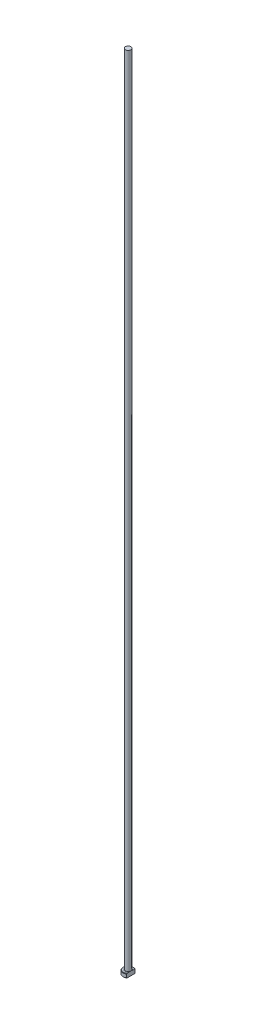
ISO-10303-21;
HEADER;
FILE_DESCRIPTION(('STEP AP214'),'2;1');
FILE_NAME('part.step','',(''),(''),'','','');
FILE_SCHEMA(('AUTOMOTIVE_DESIGN { 1 0 10303 214 1 1 1 1 }'));
ENDSEC;
DATA;
#1=APPLICATION_CONTEXT('core data for automotive mechanical design processes');
#2=APPLICATION_PROTOCOL_DEFINITION('international standard','automotive_design',2000,#1);
#3=PRODUCT_CONTEXT('',#1,'mechanical');
#4=PRODUCT('Part','Part','',(#3));
#5=PRODUCT_RELATED_PRODUCT_CATEGORY('part','',(#4));
#6=PRODUCT_DEFINITION_FORMATION('','',#4);
#7=PRODUCT_DEFINITION_CONTEXT('part definition',#1,'design');
#8=PRODUCT_DEFINITION('design','',#6,#7);
#9=PRODUCT_DEFINITION_SHAPE('','',#8);
#10=(LENGTH_UNIT() NAMED_UNIT(*) SI_UNIT(.MILLI.,.METRE.));
#11=(NAMED_UNIT(*) PLANE_ANGLE_UNIT() SI_UNIT($,.RADIAN.));
#12=(NAMED_UNIT(*) SI_UNIT($,.STERADIAN.) SOLID_ANGLE_UNIT());
#13=UNCERTAINTY_MEASURE_WITH_UNIT(LENGTH_MEASURE(1.E-05),#10,'distance_accuracy_value','');
#14=(GEOMETRIC_REPRESENTATION_CONTEXT(3) GLOBAL_UNCERTAINTY_ASSIGNED_CONTEXT((#13)) GLOBAL_UNIT_ASSIGNED_CONTEXT((#10,
#11,#12)) REPRESENTATION_CONTEXT('',''));
#15=CARTESIAN_POINT('',(0.,0.,0.));
#16=DIRECTION('',(0.,0.,1.));
#17=DIRECTION('',(1.,0.,0.));
#18=AXIS2_PLACEMENT_3D('',#15,#16,#17);
#19=CARTESIAN_POINT('',(0.,0.,0.));
#20=DIRECTION('',(0.,-1.,0.));
#21=DIRECTION('',(0.,0.,-1.));
#22=AXIS2_PLACEMENT_3D('',#19,#20,#21);
#23=PLANE('',#22);
#24=CARTESIAN_POINT('',(0.,0.,0.));
#25=DIRECTION('',(0.,-1.,0.));
#26=DIRECTION('',(0.,0.,-1.));
#27=AXIS2_PLACEMENT_3D('',#24,#25,#26);
#28=CIRCLE('',#27,2.30000000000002);
#29=CARTESIAN_POINT('',(1.34999999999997,0.,1.86212244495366));
#30=VERTEX_POINT('',#29);
#31=CARTESIAN_POINT('',(1.34999999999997,0.,-1.86212244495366));
#32=VERTEX_POINT('',#31);
#33=EDGE_CURVE('E98',#30,#32,#28,.T.);
#34=ORIENTED_EDGE('',*,*,#33,.T.);
#35=DIRECTION('',(0.,0.,1.));
#36=VECTOR('',#35,1.);
#37=CARTESIAN_POINT('',(1.34999999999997,0.,-2.10416254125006));
#38=LINE('',#37,#36);
#39=EDGE_CURVE('E83',#32,#30,#38,.T.);
#40=ORIENTED_EDGE('',*,*,#39,.T.);
#41=EDGE_LOOP('',(#34,#40));
#42=FACE_BOUND('',#41,.T.);
#43=ADVANCED_FACE('F32',(#42),#23,.T.);
#44=CARTESIAN_POINT('',(0.,259.958771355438,0.));
#45=DIRECTION('',(0.,1.,0.));
#46=DIRECTION('',(0.,0.,1.));
#47=AXIS2_PLACEMENT_3D('',#44,#45,#46);
#48=CYLINDRICAL_SURFACE('',#47,2.49999999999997);
#49=CARTESIAN_POINT('',(0.,1.79999999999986,0.));
#50=DIRECTION('',(0.,1.,0.));
#51=DIRECTION('',(0.,0.,1.));
#52=AXIS2_PLACEMENT_3D('',#49,#50,#51);
#53=CIRCLE('',#52,2.49999999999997);
#54=CARTESIAN_POINT('',(1.34999999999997,1.79999999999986,2.10416254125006));
#55=VERTEX_POINT('',#54);
#56=CARTESIAN_POINT('',(1.34999999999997,1.79999999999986,-2.10416254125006));
#57=VERTEX_POINT('',#56);
#58=EDGE_CURVE('E104',#55,#57,#53,.F.);
#59=ORIENTED_EDGE('',*,*,#58,.T.);
#60=DIRECTION('',(0.,-1.,0.));
#61=VECTOR('',#60,1.);
#62=CARTESIAN_POINT('',(1.34999999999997,400.,-2.10416254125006));
#63=LINE('',#62,#61);
#64=CARTESIAN_POINT('',(1.34999999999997,0.199999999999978,-2.10416254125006));
#65=VERTEX_POINT('',#64);
#66=EDGE_CURVE('E183',#57,#65,#63,.T.);
#67=ORIENTED_EDGE('',*,*,#66,.T.);
#68=CARTESIAN_POINT('',(0.,0.199999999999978,0.));
#69=DIRECTION('',(0.,-1.,0.));
#70=DIRECTION('',(0.,0.,-1.));
#71=AXIS2_PLACEMENT_3D('',#68,#69,#70);
#72=CIRCLE('',#71,2.49999999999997);
#73=CARTESIAN_POINT('',(1.34999999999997,0.199999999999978,2.10416254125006));
#74=VERTEX_POINT('',#73);
#75=EDGE_CURVE('E100',#65,#74,#72,.F.);
#76=ORIENTED_EDGE('',*,*,#75,.T.);
#77=DIRECTION('',(0.,-1.,0.));
#78=VECTOR('',#77,1.);
#79=CARTESIAN_POINT('',(1.34999999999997,400.,2.10416254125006));
#80=LINE('',#79,#78);
#81=EDGE_CURVE('E93',#55,#74,#80,.T.);
#82=ORIENTED_EDGE('',*,*,#81,.F.);
#83=EDGE_LOOP('',(#59,#67,#76,#82));
#84=FACE_BOUND('',#83,.T.);
#85=ADVANCED_FACE('F158',(#84),#48,.T.);
#86=CARTESIAN_POINT('',(-2.49999999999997,2.,0.));
#87=DIRECTION('',(0.,1.,0.));
#88=DIRECTION('',(0.,0.,1.));
#89=AXIS2_PLACEMENT_3D('',#86,#87,#88);
#90=PLANE('',#89);
#91=CARTESIAN_POINT('',(0.,2.,0.));
#92=DIRECTION('',(0.,1.,0.));
#93=DIRECTION('',(0.,0.,1.));
#94=AXIS2_PLACEMENT_3D('',#91,#92,#93);
#95=CIRCLE('',#94,2.29999999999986);
#96=CARTESIAN_POINT('',(1.34999999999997,2.,-1.86212244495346));
#97=VERTEX_POINT('',#96);
#98=CARTESIAN_POINT('',(1.34999999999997,2.,1.86212244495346));
#99=VERTEX_POINT('',#98);
#100=EDGE_CURVE('E178',#97,#99,#95,.T.);
#101=ORIENTED_EDGE('',*,*,#100,.T.);
#102=DIRECTION('',(0.,0.,-1.));
#103=VECTOR('',#102,1.);
#104=CARTESIAN_POINT('',(1.34999999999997,2.,0.));
#105=LINE('',#104,#103);
#106=CARTESIAN_POINT('',(1.34999999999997,1.99999999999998,0.761577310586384));
#107=VERTEX_POINT('',#106);
#108=EDGE_CURVE('E57',#99,#107,#105,.T.);
#109=ORIENTED_EDGE('',*,*,#108,.T.);
#110=CARTESIAN_POINT('',(0.,2.,0.));
#111=DIRECTION('',(0.,1.,0.));
#112=DIRECTION('',(0.,0.,1.));
#113=AXIS2_PLACEMENT_3D('',#110,#111,#112);
#114=CIRCLE('',#113,1.54999999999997);
#115=CARTESIAN_POINT('',(1.34999999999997,1.99999999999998,-0.761577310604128));
#116=VERTEX_POINT('',#115);
#117=EDGE_CURVE('E107',#107,#116,#114,.F.);
#118=ORIENTED_EDGE('',*,*,#117,.T.);
#119=EDGE_CURVE('E136',#116,#97,#105,.T.);
#120=ORIENTED_EDGE('',*,*,#119,.T.);
#121=EDGE_LOOP('',(#101,#109,#118,#120));
#122=FACE_BOUND('',#121,.T.);
#123=ADVANCED_FACE('F147',(#122),#90,.T.);
#124=CARTESIAN_POINT('',(0.,2.,0.));
#125=DIRECTION('',(0.,-1.,0.));
#126=DIRECTION('',(0.,0.,-1.));
#127=AXIS2_PLACEMENT_3D('',#124,#125,#126);
#128=CONICAL_SURFACE('',#127,2.29999999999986,0.785398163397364);
#129=ORIENTED_EDGE('',*,*,#58,.F.);
#130=CARTESIAN_POINT('',(1.34999999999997,-0.524919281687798,4.63220747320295));
#131=CARTESIAN_POINT('',(1.34999999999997,-0.437609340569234,4.54126266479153));
#132=CARTESIAN_POINT('',(1.34999999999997,-0.350401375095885,4.45021982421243));
#133=CARTESIAN_POINT('',(1.34999999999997,-0.176235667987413,4.26789371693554));
#134=CARTESIAN_POINT('',(1.34999999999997,-0.0892779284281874,4.17661044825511));
#135=CARTESIAN_POINT('',(1.34999999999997,0.171198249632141,3.90228319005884));
#136=CARTESIAN_POINT('',(1.34999999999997,0.344269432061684,3.71881394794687));
#137=CARTESIAN_POINT('',(1.34999999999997,0.686339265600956,3.35265578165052));
#138=CARTESIAN_POINT('',(1.34999999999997,0.855361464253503,3.16998895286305));
#139=CARTESIAN_POINT('',(1.34999999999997,1.10676804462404,2.89407002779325));
#140=CARTESIAN_POINT('',(1.34999999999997,1.19021072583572,2.8017829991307));
#141=CARTESIAN_POINT('',(1.34999999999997,1.35616107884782,2.61637299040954));
#142=CARTESIAN_POINT('',(1.34999999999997,1.43866876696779,2.52325002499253));
#143=CARTESIAN_POINT('',(1.34999999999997,1.58666506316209,2.35393986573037));
#144=CARTESIAN_POINT('',(1.34999999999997,1.65237203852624,2.27794381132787));
#145=CARTESIAN_POINT('',(1.34999999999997,1.78272599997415,2.12503384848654));
#146=CARTESIAN_POINT('',(1.34999999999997,1.84737288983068,2.04811985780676));
#147=CARTESIAN_POINT('',(1.34999999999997,1.97578051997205,1.8924719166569));
#148=CARTESIAN_POINT('',(1.34999999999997,2.0395293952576,1.81372814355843));
#149=CARTESIAN_POINT('',(1.34999999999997,2.16502964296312,1.65468665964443));
#150=CARTESIAN_POINT('',(1.34999999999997,2.22678149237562,1.57438932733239));
#151=CARTESIAN_POINT('',(1.34999999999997,2.34821109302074,1.41068778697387));
#152=CARTESIAN_POINT('',(1.34999999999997,2.40785394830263,1.32725749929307));
#153=CARTESIAN_POINT('',(1.34999999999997,2.5229207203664,1.15733795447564));
#154=CARTESIAN_POINT('',(1.34999999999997,2.57833930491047,1.07084502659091));
#155=CARTESIAN_POINT('',(1.34999999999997,2.68200172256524,0.894688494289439));
#156=CARTESIAN_POINT('',(1.34999999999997,2.73030792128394,0.805062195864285));
#157=CARTESIAN_POINT('',(1.34999999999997,2.81628592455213,0.620872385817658));
#158=CARTESIAN_POINT('',(1.34999999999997,2.8539888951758,0.526324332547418));
#159=CARTESIAN_POINT('',(1.34999999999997,2.89712682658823,0.383943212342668));
#160=CARTESIAN_POINT('',(1.34999999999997,2.90904798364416,0.338082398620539));
#161=CARTESIAN_POINT('',(1.34999999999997,2.92861548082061,0.245444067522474));
#162=CARTESIAN_POINT('',(1.34999999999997,2.93626244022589,0.198666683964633));
#163=CARTESIAN_POINT('',(1.34999999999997,2.94673600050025,0.104809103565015));
#164=CARTESIAN_POINT('',(1.34999999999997,2.9495872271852,0.0577317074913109));
#165=CARTESIAN_POINT('',(1.34999999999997,2.95032901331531,-0.0364641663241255));
#166=CARTESIAN_POINT('',(1.34999999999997,2.94821949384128,-0.0835826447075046));
#167=CARTESIAN_POINT('',(1.34999999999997,2.93922391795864,-0.17711502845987));
#168=CARTESIAN_POINT('',(1.34999999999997,2.93236161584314,-0.223531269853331));
#169=CARTESIAN_POINT('',(1.34999999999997,2.91435204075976,-0.315528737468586));
#170=CARTESIAN_POINT('',(1.34999999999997,2.90320298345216,-0.361109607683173));
#171=CARTESIAN_POINT('',(1.34999999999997,2.87715789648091,-0.451518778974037));
#172=CARTESIAN_POINT('',(1.34999999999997,2.86223608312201,-0.496339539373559));
#173=CARTESIAN_POINT('',(1.34999999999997,2.82934295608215,-0.5848230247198));
#174=CARTESIAN_POINT('',(1.34999999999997,2.81137212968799,-0.628485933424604));
#175=CARTESIAN_POINT('',(1.34999999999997,2.7584724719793,-0.74726996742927));
#176=CARTESIAN_POINT('',(1.34999999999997,2.7209858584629,-0.821247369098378));
#177=CARTESIAN_POINT('',(1.34999999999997,2.64086295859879,-0.966383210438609));
#178=CARTESIAN_POINT('',(1.34999999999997,2.59822112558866,-1.03753850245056));
#179=CARTESIAN_POINT('',(1.34999999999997,2.50923184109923,-1.17783613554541));
#180=CARTESIAN_POINT('',(1.34999999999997,2.46287145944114,-1.24697020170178));
#181=CARTESIAN_POINT('',(1.34999999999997,2.3676446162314,-1.38343072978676));
#182=CARTESIAN_POINT('',(1.34999999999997,2.31877921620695,-1.45075793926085));
#183=CARTESIAN_POINT('',(1.34999999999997,2.21858850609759,-1.58486082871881));
#184=CARTESIAN_POINT('',(1.34999999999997,2.16724014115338,-1.65161920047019));
#185=CARTESIAN_POINT('',(1.34999999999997,2.0631299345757,-1.78402712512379));
#186=CARTESIAN_POINT('',(1.34999999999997,2.01036799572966,-1.84967660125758));
#187=CARTESIAN_POINT('',(1.34999999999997,1.85072242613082,-2.04502635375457));
#188=CARTESIAN_POINT('',(1.34999999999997,1.74225068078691,-2.17342678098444));
#189=CARTESIAN_POINT('',(1.34999999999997,1.54426345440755,-2.40295980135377));
#190=CARTESIAN_POINT('',(1.34999999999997,1.45520943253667,-2.50449462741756));
#191=CARTESIAN_POINT('',(1.34999999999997,1.27587070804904,-2.70647652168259));
#192=CARTESIAN_POINT('',(1.34999999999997,1.18558597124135,-2.80692355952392));
#193=CARTESIAN_POINT('',(1.34999999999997,0.913238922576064,-3.10722245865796));
#194=CARTESIAN_POINT('',(1.34999999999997,0.72983699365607,-3.30585698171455));
#195=CARTESIAN_POINT('',(1.34999999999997,0.368419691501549,-3.69315491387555));
#196=CARTESIAN_POINT('',(1.34999999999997,0.190487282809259,-3.88189615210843));
#197=CARTESIAN_POINT('',(1.34999999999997,-0.077272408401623,-4.16399820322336));
#198=CARTESIAN_POINT('',(1.34999999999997,-0.166621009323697,-4.25781388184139));
#199=CARTESIAN_POINT('',(1.34999999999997,-0.34558373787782,-4.4451899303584));
#200=CARTESIAN_POINT('',(1.34999999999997,-0.435197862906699,-4.53875030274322));
#201=CARTESIAN_POINT('',(1.34999999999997,-0.524919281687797,-4.63220747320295));
#202=B_SPLINE_CURVE_WITH_KNOTS('',3,(#130,#131,#132,#133,#134,#135,#136,#137,#138,#139,#140,
#141,#142,#143,#144,#145,#146,#147,#148,#149,#150,#151,#152,#153,#154,#155,#156,#157,#158,#159,
#160,#161,#162,#163,#164,#165,#166,#167,#168,#169,#170,#171,#172,#173,#174,#175,#176,#177,#178,
#179,#180,#181,#182,#183,#184,#185,#186,#187,#188,#189,#190,#191,#192,#193,#194,#195,#196,#197,
#198,#199,#200,#201),.UNSPECIFIED.,.F.,.F.,(4,2,2,2,2,2,2,2,2,2,2,2,2,2,2,2,2,2,2,2,2,2,2,2,2,2,
2,2,2,2,2,2,2,2,2,4),(0.,0.378214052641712,0.756431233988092,1.51308288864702,2.25966743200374,
2.63291386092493,3.00615376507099,3.30753536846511,3.6089441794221,3.91286335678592,
4.21670939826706,4.52429630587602,4.83226525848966,5.13734835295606,5.44152511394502,
5.58351223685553,5.72547878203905,5.86671408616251,6.00795163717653,6.14848833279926,
6.28908358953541,6.43066697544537,6.57222775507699,6.82069043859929,7.06942287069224,
7.31906118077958,7.56859456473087,7.82123528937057,8.07389343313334,8.57808208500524,
8.98323970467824,9.38840860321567,10.1994443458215,10.9776078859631,11.3662730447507,
11.7549344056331),.UNSPECIFIED.);
#203=EDGE_CURVE('E135',#55,#99,#202,.T.);
#204=ORIENTED_EDGE('',*,*,#203,.T.);
#205=ORIENTED_EDGE('',*,*,#100,.F.);
#206=EDGE_CURVE('E127',#97,#57,#202,.T.);
#207=ORIENTED_EDGE('',*,*,#206,.T.);
#208=EDGE_LOOP('',(#129,#204,#205,#207));
#209=FACE_BOUND('',#208,.T.);
#210=ADVANCED_FACE('F143',(#209),#128,.T.);
#211=CARTESIAN_POINT('',(0.,0.199999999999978,0.));
#212=DIRECTION('',(0.,1.,0.));
#213=DIRECTION('',(0.,0.,1.));
#214=AXIS2_PLACEMENT_3D('',#211,#212,#213);
#215=CONICAL_SURFACE('',#214,2.49999999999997,0.785398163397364);
#216=ORIENTED_EDGE('',*,*,#75,.F.);
#217=CARTESIAN_POINT('',(1.34999999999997,2.52491928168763,-4.63220747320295));
#218=CARTESIAN_POINT('',(1.34999999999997,2.43760934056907,-4.54126266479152));
#219=CARTESIAN_POINT('',(1.34999999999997,2.35040137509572,-4.45021982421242));
#220=CARTESIAN_POINT('',(1.34999999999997,2.17623566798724,-4.26789371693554));
#221=CARTESIAN_POINT('',(1.34999999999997,2.08927792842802,-4.17661044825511));
#222=CARTESIAN_POINT('',(1.34999999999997,1.82880175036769,-3.90228319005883));
#223=CARTESIAN_POINT('',(1.34999999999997,1.65573056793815,-3.71881394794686));
#224=CARTESIAN_POINT('',(1.34999999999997,1.31366073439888,-3.35265578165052));
#225=CARTESIAN_POINT('',(1.34999999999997,1.14463853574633,-3.16998895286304));
#226=CARTESIAN_POINT('',(1.34999999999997,0.893231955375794,-2.89407002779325));
#227=CARTESIAN_POINT('',(1.34999999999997,0.809789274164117,-2.8017829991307));
#228=CARTESIAN_POINT('',(1.34999999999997,0.643838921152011,-2.61637299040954));
#229=CARTESIAN_POINT('',(1.34999999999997,0.561331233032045,-2.52325002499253));
#230=CARTESIAN_POINT('',(1.34999999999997,0.413334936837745,-2.35393986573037));
#231=CARTESIAN_POINT('',(1.34999999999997,0.347627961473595,-2.27794381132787));
#232=CARTESIAN_POINT('',(1.34999999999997,0.217274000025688,-2.12503384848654));
#233=CARTESIAN_POINT('',(1.34999999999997,0.152627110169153,-2.04811985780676));
#234=CARTESIAN_POINT('',(1.34999999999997,0.0242194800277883,-1.8924719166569));
#235=CARTESIAN_POINT('',(1.34999999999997,-0.0395293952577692,-1.81372814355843));
#236=CARTESIAN_POINT('',(1.34999999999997,-0.165029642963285,-1.65468665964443));
#237=CARTESIAN_POINT('',(1.34999999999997,-0.226781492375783,-1.57438932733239));
#238=CARTESIAN_POINT('',(1.34999999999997,-0.348211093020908,-1.41068778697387));
#239=CARTESIAN_POINT('',(1.34999999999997,-0.407853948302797,-1.32725749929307));
#240=CARTESIAN_POINT('',(1.34999999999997,-0.52292072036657,-1.15733795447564));
#241=CARTESIAN_POINT('',(1.34999999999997,-0.578339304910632,-1.07084502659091));
#242=CARTESIAN_POINT('',(1.34999999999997,-0.68200172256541,-0.894688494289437));
#243=CARTESIAN_POINT('',(1.34999999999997,-0.730307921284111,-0.805062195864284));
#244=CARTESIAN_POINT('',(1.34999999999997,-0.8162859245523,-0.620872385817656));
#245=CARTESIAN_POINT('',(1.34999999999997,-0.853988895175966,-0.526324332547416));
#246=CARTESIAN_POINT('',(1.34999999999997,-0.8971268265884,-0.383943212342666));
#247=CARTESIAN_POINT('',(1.34999999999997,-0.90904798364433,-0.338082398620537));
#248=CARTESIAN_POINT('',(1.34999999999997,-0.928615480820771,-0.245444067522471));
#249=CARTESIAN_POINT('',(1.34999999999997,-0.936262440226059,-0.198666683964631));
#250=CARTESIAN_POINT('',(1.34999999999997,-0.946736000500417,-0.104809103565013));
#251=CARTESIAN_POINT('',(1.34999999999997,-0.949587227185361,-0.0577317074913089));
#252=CARTESIAN_POINT('',(1.34999999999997,-0.950329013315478,0.0364641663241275));
#253=CARTESIAN_POINT('',(1.34999999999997,-0.948219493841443,0.0835826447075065));
#254=CARTESIAN_POINT('',(1.34999999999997,-0.939223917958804,0.177115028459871));
#255=CARTESIAN_POINT('',(1.34999999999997,-0.932361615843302,0.223531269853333));
#256=CARTESIAN_POINT('',(1.34999999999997,-0.914352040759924,0.315528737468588));
#257=CARTESIAN_POINT('',(1.34999999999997,-0.903202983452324,0.361109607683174));
#258=CARTESIAN_POINT('',(1.34999999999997,-0.877157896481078,0.451518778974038));
#259=CARTESIAN_POINT('',(1.34999999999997,-0.862236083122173,0.49633953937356));
#260=CARTESIAN_POINT('',(1.34999999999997,-0.829342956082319,0.584823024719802));
#261=CARTESIAN_POINT('',(1.34999999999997,-0.811372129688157,0.628485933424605));
#262=CARTESIAN_POINT('',(1.34999999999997,-0.758472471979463,0.747269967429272));
#263=CARTESIAN_POINT('',(1.34999999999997,-0.720985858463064,0.821247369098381));
#264=CARTESIAN_POINT('',(1.34999999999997,-0.640862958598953,0.966383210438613));
#265=CARTESIAN_POINT('',(1.34999999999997,-0.598221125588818,1.03753850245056));
#266=CARTESIAN_POINT('',(1.34999999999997,-0.509231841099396,1.17783613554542));
#267=CARTESIAN_POINT('',(1.34999999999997,-0.462871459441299,1.24697020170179));
#268=CARTESIAN_POINT('',(1.34999999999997,-0.367644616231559,1.38343072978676));
#269=CARTESIAN_POINT('',(1.34999999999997,-0.318779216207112,1.45075793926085));
#270=CARTESIAN_POINT('',(1.34999999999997,-0.218588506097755,1.58486082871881));
#271=CARTESIAN_POINT('',(1.34999999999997,-0.167240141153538,1.65161920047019));
#272=CARTESIAN_POINT('',(1.34999999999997,-0.0631299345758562,1.78402712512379));
#273=CARTESIAN_POINT('',(1.34999999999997,-0.0103679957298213,1.84967660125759));
#274=CARTESIAN_POINT('',(1.34999999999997,0.149277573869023,2.04502635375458));
#275=CARTESIAN_POINT('',(1.34999999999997,0.257749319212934,2.17342678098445));
#276=CARTESIAN_POINT('',(1.34999999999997,0.455736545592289,2.40295980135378));
#277=CARTESIAN_POINT('',(1.34999999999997,0.544790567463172,2.50449462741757));
#278=CARTESIAN_POINT('',(1.34999999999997,0.724129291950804,2.7064765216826));
#279=CARTESIAN_POINT('',(1.34999999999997,0.814414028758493,2.80692355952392));
#280=CARTESIAN_POINT('',(1.34999999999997,1.08676107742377,3.10722245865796));
#281=CARTESIAN_POINT('',(1.34999999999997,1.27016300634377,3.30585698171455));
#282=CARTESIAN_POINT('',(1.34999999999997,1.63158030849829,3.69315491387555));
#283=CARTESIAN_POINT('',(1.34999999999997,1.80951271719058,3.88189615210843));
#284=CARTESIAN_POINT('',(1.34999999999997,2.07727240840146,4.16399820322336));
#285=CARTESIAN_POINT('',(1.34999999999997,2.16662100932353,4.25781388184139));
#286=CARTESIAN_POINT('',(1.34999999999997,2.34558373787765,4.4451899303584));
#287=CARTESIAN_POINT('',(1.34999999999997,2.43519786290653,4.53875030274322));
#288=CARTESIAN_POINT('',(1.34999999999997,2.52491928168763,4.63220747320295));
#289=B_SPLINE_CURVE_WITH_KNOTS('',3,(#217,#218,#219,#220,#221,#222,#223,#224,#225,#226,#227,
#228,#229,#230,#231,#232,#233,#234,#235,#236,#237,#238,#239,#240,#241,#242,#243,#244,#245,#246,
#247,#248,#249,#250,#251,#252,#253,#254,#255,#256,#257,#258,#259,#260,#261,#262,#263,#264,#265,
#266,#267,#268,#269,#270,#271,#272,#273,#274,#275,#276,#277,#278,#279,#280,#281,#282,#283,#284,
#285,#286,#287,#288),.UNSPECIFIED.,.F.,.F.,(4,2,2,2,2,2,2,2,2,2,2,2,2,2,2,2,2,2,2,2,2,2,2,2,2,2,
2,2,2,2,2,2,2,2,2,4),(0.,0.378214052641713,0.756431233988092,1.51308288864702,2.25966743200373,
2.63291386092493,3.00615376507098,3.3075353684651,3.60894417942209,3.91286335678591,
4.21670939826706,4.52429630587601,4.83226525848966,5.13734835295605,5.44152511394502,
5.58351223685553,5.72547878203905,5.86671408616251,6.00795163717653,6.14848833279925,
6.2890835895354,6.43066697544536,6.57222775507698,6.82069043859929,7.06942287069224,
7.31906118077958,7.56859456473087,7.82123528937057,8.07389343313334,8.57808208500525,
8.98323970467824,9.38840860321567,10.1994443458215,10.977607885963,11.3662730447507,
11.7549344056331),.UNSPECIFIED.);
#290=EDGE_CURVE('E86',#65,#32,#289,.T.);
#291=ORIENTED_EDGE('',*,*,#290,.T.);
#292=ORIENTED_EDGE('',*,*,#33,.F.);
#293=EDGE_CURVE('E89',#30,#74,#289,.T.);
#294=ORIENTED_EDGE('',*,*,#293,.T.);
#295=EDGE_LOOP('',(#216,#291,#292,#294));
#296=FACE_BOUND('',#295,.T.);
#297=ADVANCED_FACE('F97',(#296),#215,.T.);
#298=CARTESIAN_POINT('',(0.,2.19999999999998,0.));
#299=DIRECTION('',(0.,1.,0.));
#300=DIRECTION('',(0.,0.,1.));
#301=AXIS2_PLACEMENT_3D('',#298,#299,#300);
#302=TOROIDAL_SURFACE('',#301,1.54999999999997,0.2);
#303=CARTESIAN_POINT('',(1.34999999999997,2.19999999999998,0.));
#304=CARTESIAN_POINT('',(1.34999999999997,2.20000051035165,-6.93386413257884E-11));
#305=CARTESIAN_POINT('',(1.34999999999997,2.20000102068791,-1.14040096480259E-07));
#306=CARTESIAN_POINT('',(1.34999999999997,2.2000020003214,-4.70904764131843E-07));
#307=CARTESIAN_POINT('',(1.34999999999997,2.20000246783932,-7.1771368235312E-07));
#308=CARTESIAN_POINT('',(1.34999999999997,2.20000340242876,-1.30966222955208E-06));
#309=CARTESIAN_POINT('',(1.34999999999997,2.20000386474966,-1.662182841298E-06));
#310=CARTESIAN_POINT('',(1.34999999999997,2.20000473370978,-2.41969342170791E-06));
#311=CARTESIAN_POINT('',(1.34999999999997,2.20000514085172,-2.82413349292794E-06));
#312=CARTESIAN_POINT('',(1.34999999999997,2.20000651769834,-4.28387658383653E-06));
#313=CARTESIAN_POINT('',(1.34999999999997,2.20000741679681,-5.40686565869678E-06));
#314=CARTESIAN_POINT('',(1.34999999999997,2.20000900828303,-7.71855157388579E-06));
#315=CARTESIAN_POINT('',(1.34999999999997,2.20000970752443,-8.90279582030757E-06));
#316=CARTESIAN_POINT('',(1.34999999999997,2.20001236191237,-1.3560882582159E-05));
#317=CARTESIAN_POINT('',(1.34999999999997,2.20001418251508,-1.71153577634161E-05));
#318=CARTESIAN_POINT('',(1.34999999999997,2.20001713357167,-2.4096378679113E-05));
#319=CARTESIAN_POINT('',(1.34999999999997,2.20001831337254,-2.75026560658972E-05));
#320=CARTESIAN_POINT('',(1.34999999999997,2.20002337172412,-4.21136205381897E-05));
#321=CARTESIAN_POINT('',(1.34999999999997,2.20002724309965,-5.33128878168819E-05));
#322=CARTESIAN_POINT('',(1.34999999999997,2.20003341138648,-7.4213259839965E-05));
#323=CARTESIAN_POINT('',(1.34999999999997,2.20003586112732,-8.38672294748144E-05));
#324=CARTESIAN_POINT('',(1.34999999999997,2.20005538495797,-0.000154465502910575));
#325=CARTESIAN_POINT('',(1.34999999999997,2.20008043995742,-0.000212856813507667));
#326=CARTESIAN_POINT('',(1.34999999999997,2.20017457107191,-0.000440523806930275));
#327=CARTESIAN_POINT('',(1.34999999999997,2.2002377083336,-0.000611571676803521));
#328=CARTESIAN_POINT('',(1.34999999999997,2.20048725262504,-0.00127779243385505));
#329=CARTESIAN_POINT('',(1.34999999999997,2.2006798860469,-0.00177115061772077));
#330=CARTESIAN_POINT('',(1.34999999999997,2.20146612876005,-0.00379437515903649));
#331=CARTESIAN_POINT('',(1.34999999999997,2.20205268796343,-0.0053262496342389));
#332=CARTESIAN_POINT('',(1.34999999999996,2.20919457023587,-0.0239661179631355));
#333=CARTESIAN_POINT('',(1.34999999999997,2.21579238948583,-0.0410623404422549));
#334=CARTESIAN_POINT('',(1.34999999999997,2.22866578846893,-0.074650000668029));
#335=CARTESIAN_POINT('',(1.34999999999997,2.23494426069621,-0.0911404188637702));
#336=CARTESIAN_POINT('',(1.34999999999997,2.24814459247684,-0.126093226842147));
#337=CARTESIAN_POINT('',(1.34999999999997,2.25505545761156,-0.144559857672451));
#338=CARTESIAN_POINT('',(1.34999999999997,2.26876393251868,-0.181748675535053));
#339=CARTESIAN_POINT('',(1.34999999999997,2.27555967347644,-0.200471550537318));
#340=CARTESIAN_POINT('',(1.34999999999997,2.29202668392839,-0.246805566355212));
#341=CARTESIAN_POINT('',(1.34999999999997,2.30155256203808,-0.274468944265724));
#342=CARTESIAN_POINT('',(1.34999999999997,2.31961149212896,-0.329392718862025));
#343=CARTESIAN_POINT('',(1.34999999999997,2.32816274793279,-0.356647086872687));
#344=CARTESIAN_POINT('',(1.34999999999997,2.34540016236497,-0.415248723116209));
#345=CARTESIAN_POINT('',(1.34999999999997,2.35394063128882,-0.446639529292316));
#346=CARTESIAN_POINT('',(1.34999999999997,2.36937995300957,-0.510082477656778));
#347=CARTESIAN_POINT('',(1.34999999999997,2.3762658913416,-0.542137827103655));
#348=CARTESIAN_POINT('',(1.34999999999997,2.38814240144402,-0.608749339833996));
#349=CARTESIAN_POINT('',(1.34999999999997,2.39298194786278,-0.64333337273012));
#350=CARTESIAN_POINT('',(1.34999999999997,2.39922141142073,-0.712731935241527));
#351=CARTESIAN_POINT('',(1.34999999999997,2.40063314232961,-0.747545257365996));
#352=CARTESIAN_POINT('',(1.34999999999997,2.39899063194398,-0.811125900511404));
#353=CARTESIAN_POINT('',(1.34999999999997,2.39665955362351,-0.839907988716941));
#354=CARTESIAN_POINT('',(1.34999999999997,2.3878724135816,-0.896503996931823));
#355=CARTESIAN_POINT('',(1.34999999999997,2.3814773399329,-0.924325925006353));
#356=CARTESIAN_POINT('',(1.34999999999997,2.36777648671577,-0.964713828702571));
#357=CARTESIAN_POINT('',(1.34999999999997,2.36251387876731,-0.977971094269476));
#358=CARTESIAN_POINT('',(1.34999999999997,2.35035650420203,-1.00376929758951));
#359=CARTESIAN_POINT('',(1.34999999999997,2.34345879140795,-1.01630889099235));
#360=CARTESIAN_POINT('',(1.34999999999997,2.329139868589,-1.03811283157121));
#361=CARTESIAN_POINT('',(1.34999999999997,2.32201405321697,-1.04756908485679));
#362=CARTESIAN_POINT('',(1.34999999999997,2.30635495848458,-1.06523411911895));
#363=CARTESIAN_POINT('',(1.34999999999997,2.29782508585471,-1.07344582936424));
#364=CARTESIAN_POINT('',(1.34999999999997,2.28196145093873,-1.08598464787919));
#365=CARTESIAN_POINT('',(1.34999999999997,2.274977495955,-1.09075233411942));
#366=CARTESIAN_POINT('',(1.34999999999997,2.26033012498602,-1.09910941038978));
#367=CARTESIAN_POINT('',(1.34999999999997,2.25266710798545,-1.10269948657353));
#368=CARTESIAN_POINT('',(1.34999999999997,2.23673989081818,-1.1084681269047));
#369=CARTESIAN_POINT('',(1.34999999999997,2.22847092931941,-1.1106337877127));
#370=CARTESIAN_POINT('',(1.34999999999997,2.21166869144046,-1.11329753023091));
#371=CARTESIAN_POINT('',(1.34999999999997,2.20313564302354,-1.11379701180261));
#372=CARTESIAN_POINT('',(1.34999999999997,2.18727799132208,-1.11313057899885));
#373=CARTESIAN_POINT('',(1.34999999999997,2.17994351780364,-1.11217719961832));
#374=CARTESIAN_POINT('',(1.34999999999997,2.16553907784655,-1.10905798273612));
#375=CARTESIAN_POINT('',(1.34999999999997,2.15846915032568,-1.10689196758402));
#376=CARTESIAN_POINT('',(1.34999999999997,2.14470559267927,-1.10147189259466));
#377=CARTESIAN_POINT('',(1.34999999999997,2.13801509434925,-1.09820998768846));
#378=CARTESIAN_POINT('',(1.34999999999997,2.12516220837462,-1.0907816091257));
#379=CARTESIAN_POINT('',(1.34999999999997,2.119000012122,-1.08661480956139));
#380=CARTESIAN_POINT('',(1.34999999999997,2.10390058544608,-1.07497116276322));
#381=CARTESIAN_POINT('',(1.34999999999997,2.09537574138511,-1.06695869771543));
#382=CARTESIAN_POINT('',(1.34999999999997,2.07969650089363,-1.04968237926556));
#383=CARTESIAN_POINT('',(1.34999999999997,2.07254642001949,-1.04041473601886));
#384=CARTESIAN_POINT('',(1.34999999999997,2.0559393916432,-1.01572772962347));
#385=CARTESIAN_POINT('',(1.34999999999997,2.04736349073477,-0.99971889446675));
#386=CARTESIAN_POINT('',(1.34999999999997,2.03274927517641,-0.966649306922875));
#387=CARTESIAN_POINT('',(1.34999999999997,2.02670979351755,-0.949589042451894));
#388=CARTESIAN_POINT('',(1.34999999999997,2.01301888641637,-0.902192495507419));
#389=CARTESIAN_POINT('',(1.34999999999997,2.00741820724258,-0.871270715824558));
#390=CARTESIAN_POINT('',(1.34999999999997,2.0006455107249,-0.808563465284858));
#391=CARTESIAN_POINT('',(1.34999999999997,1.99954416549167,-0.776772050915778));
#392=CARTESIAN_POINT('',(1.34999999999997,2.00095999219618,-0.704102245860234));
#393=CARTESIAN_POINT('',(1.34999999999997,2.00461462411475,-0.663252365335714));
#394=CARTESIAN_POINT('',(1.34999999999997,2.01597234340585,-0.582010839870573));
#395=CARTESIAN_POINT('',(1.34999999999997,2.02369178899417,-0.54162172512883));
#396=CARTESIAN_POINT('',(1.34999999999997,2.04136563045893,-0.464405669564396));
#397=CARTESIAN_POINT('',(1.34999999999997,2.05111943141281,-0.427531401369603));
#398=CARTESIAN_POINT('',(1.34999999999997,2.07231971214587,-0.354637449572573));
#399=CARTESIAN_POINT('',(1.34999999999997,2.08375041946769,-0.318613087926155));
#400=CARTESIAN_POINT('',(1.34999999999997,2.1024239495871,-0.263006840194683));
#401=CARTESIAN_POINT('',(1.34999999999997,2.10925115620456,-0.243282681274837));
#402=CARTESIAN_POINT('',(1.34999999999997,2.12336489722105,-0.203437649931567));
#403=CARTESIAN_POINT('',(1.34999999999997,2.13065867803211,-0.183319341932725));
#404=CARTESIAN_POINT('',(1.34999999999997,2.14313587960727,-0.149463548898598));
#405=CARTESIAN_POINT('',(1.34999999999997,2.1482631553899,-0.135705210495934));
#406=CARTESIAN_POINT('',(1.34999999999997,2.15854219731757,-0.108353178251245));
#407=CARTESIAN_POINT('',(1.34999999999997,2.16369321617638,-0.0947592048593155));
#408=CARTESIAN_POINT('',(1.34999999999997,2.17349784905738,-0.0690071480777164));
#409=CARTESIAN_POINT('',(1.34999999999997,2.17814722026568,-0.0568473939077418));
#410=CARTESIAN_POINT('',(1.34999999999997,2.18766064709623,-0.0320803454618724));
#411=CARTESIAN_POINT('',(1.34999999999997,2.1925261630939,-0.019473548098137));
#412=CARTESIAN_POINT('',(1.34999999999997,2.19794687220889,-0.00532758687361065));
#413=CARTESIAN_POINT('',(1.34999999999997,2.19853287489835,-0.00379701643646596));
#414=CARTESIAN_POINT('',(1.34999999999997,2.19931897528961,-0.00177410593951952));
#415=CARTESIAN_POINT('',(1.34999999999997,2.19951199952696,-0.00127975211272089));
#416=CARTESIAN_POINT('',(1.34999999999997,2.19976201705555,-0.000612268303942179));
#417=CARTESIAN_POINT('',(1.34999999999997,2.19982525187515,-0.000440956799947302));
#418=CARTESIAN_POINT('',(1.34999999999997,2.19991951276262,-0.000212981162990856));
#419=CARTESIAN_POINT('',(1.34999999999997,2.19994458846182,-0.000154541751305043));
#420=CARTESIAN_POINT('',(1.34999999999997,2.19996412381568,-8.38889589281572E-05));
#421=CARTESIAN_POINT('',(1.34999999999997,2.19996657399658,-7.42314656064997E-05));
#422=CARTESIAN_POINT('',(1.34999999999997,2.1999727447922,-5.33232983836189E-05));
#423=CARTESIAN_POINT('',(1.34999999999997,2.19997661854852,-4.21198546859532E-05));
#424=CARTESIAN_POINT('',(1.34999999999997,2.19998167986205,-2.75042074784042E-05));
#425=CARTESIAN_POINT('',(1.34999999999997,2.19998286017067,-2.40973903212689E-05));
#426=CARTESIAN_POINT('',(1.34999999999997,2.19998581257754,-1.71153452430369E-05));
#427=CARTESIAN_POINT('',(1.34999999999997,2.19998763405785,-1.35604061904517E-05));
#428=CARTESIAN_POINT('',(1.34999999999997,2.19999028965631,-8.90187906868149E-06));
#429=CARTESIAN_POINT('',(1.34999999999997,2.19999098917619,-7.7175929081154E-06));
#430=CARTESIAN_POINT('',(1.34999999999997,2.19999258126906,-5.40587786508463E-06));
#431=CARTESIAN_POINT('',(1.34999999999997,2.19999348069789,-4.28290463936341E-06));
#432=CARTESIAN_POINT('',(1.34999999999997,2.19999485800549,-2.82324857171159E-06));
#433=CARTESIAN_POINT('',(1.34999999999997,2.19999526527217,-2.41884666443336E-06));
#434=CARTESIAN_POINT('',(1.34999999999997,2.19999613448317,-1.66143479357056E-06));
#435=CARTESIAN_POINT('',(1.34999999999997,2.19999659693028,-1.30897501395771E-06));
#436=CARTESIAN_POINT('',(1.34999999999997,2.19999753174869,-7.17173367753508E-07));
#437=CARTESIAN_POINT('',(1.34999999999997,2.19999799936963,-4.70447275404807E-07));
#438=CARTESIAN_POINT('',(1.34999999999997,2.19999897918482,-1.13784244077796E-07));
#439=CARTESIAN_POINT('',(1.34999999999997,2.19999948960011,6.93451898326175E-11));
#440=CARTESIAN_POINT('',(1.34999999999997,2.19999999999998,0.));
#441=B_SPLINE_CURVE_WITH_KNOTS('',3,(#303,#304,#305,#306,#307,#308,#309,#310,#311,#312,#313,
#314,#315,#316,#317,#318,#319,#320,#321,#322,#323,#324,#325,#326,#327,#328,#329,#330,#331,#332,
#333,#334,#335,#336,#337,#338,#339,#340,#341,#342,#343,#344,#345,#346,#347,#348,#349,#350,#351,
#352,#353,#354,#355,#356,#357,#358,#359,#360,#361,#362,#363,#364,#365,#366,#367,#368,#369,#370,
#371,#372,#373,#374,#375,#376,#377,#378,#379,#380,#381,#382,#383,#384,#385,#386,#387,#388,#389,
#390,#391,#392,#393,#394,#395,#396,#397,#398,#399,#400,#401,#402,#403,#404,#405,#406,#407,#408,
#409,#410,#411,#412,#413,#414,#415,#416,#417,#418,#419,#420,#421,#422,#423,#424,#425,#426,#427,
#428,#429,#430,#431,#432,#433,#434,#435,#436,#437,#438,#439,#440),.UNSPECIFIED.,.T.,.F.,(4,2,2,
2,2,2,2,2,2,2,2,2,2,2,2,2,2,2,2,2,2,2,2,2,2,2,2,2,2,2,2,2,2,2,2,2,2,2,2,2,2,2,2,2,2,2,2,2,2,2,2,
2,2,2,2,2,2,2,2,2,2,2,2,2,2,2,2,2,4),(0.,1.53064488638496E-06,3.1090904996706E-06,
4.84589729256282E-06,6.56562952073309E-06,1.08607277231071E-05,1.49832635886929E-05,
2.69283135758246E-05,3.77311402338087E-05,7.32737119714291E-05,0.000103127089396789,
0.000293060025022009,0.000840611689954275,0.00242879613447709,0.00735055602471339,
0.0623205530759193,0.115257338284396,0.174408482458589,0.234161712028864,0.321925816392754,
0.407605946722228,0.50516586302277,0.603464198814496,0.708107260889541,0.81238916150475,
0.898818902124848,0.983981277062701,1.02669027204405,1.0694768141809,1.10488501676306,
1.1402085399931,1.16548550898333,1.19074772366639,1.21623573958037,1.24170233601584,
1.26378399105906,1.28586888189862,1.30811536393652,1.33036987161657,1.36526774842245,
1.40027344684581,1.45444967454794,1.50860094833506,1.6023504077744,1.69756687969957,
1.82029471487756,1.94352026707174,2.05788606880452,2.17123799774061,2.23385323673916,
2.29805014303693,2.34209804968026,2.38570907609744,2.42476491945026,2.46530034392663,
2.47021786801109,2.47180925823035,2.47235765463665,2.4725477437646,2.47257760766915,
2.47261316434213,2.47262396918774,2.47263591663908,2.4726400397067,2.4726443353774,
2.47264605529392,2.47264779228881,2.47264937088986,2.4726509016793),.UNSPECIFIED.);
#442=CARTESIAN_POINT('',(1.34999999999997,2.19999999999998,0.));
#443=VERTEX_POINT('',#442);
#444=EDGE_CURVE('E11',#116,#443,#441,.T.);
#445=ORIENTED_EDGE('',*,*,#444,.F.);
#446=ORIENTED_EDGE('',*,*,#117,.F.);
#447=CARTESIAN_POINT('',(1.34999999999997,2.19999999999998,0.));
#448=CARTESIAN_POINT('',(1.34999999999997,2.19999948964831,6.93385670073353E-11));
#449=CARTESIAN_POINT('',(1.34999999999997,2.19999897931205,1.14040096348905E-07));
#450=CARTESIAN_POINT('',(1.34999999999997,2.19999799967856,4.7090476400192E-07));
#451=CARTESIAN_POINT('',(1.34999999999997,2.19999753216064,7.17713682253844E-07));
#452=CARTESIAN_POINT('',(1.34999999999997,2.1999965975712,1.30966222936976E-06));
#453=CARTESIAN_POINT('',(1.34999999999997,2.1999961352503,1.66218284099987E-06));
#454=CARTESIAN_POINT('',(1.34999999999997,2.19999526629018,2.41969342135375E-06));
#455=CARTESIAN_POINT('',(1.34999999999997,2.19999485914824,2.8241334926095E-06));
#456=CARTESIAN_POINT('',(1.34999999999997,2.19999348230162,4.28387658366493E-06));
#457=CARTESIAN_POINT('',(1.34999999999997,2.19999258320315,5.40686565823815E-06));
#458=CARTESIAN_POINT('',(1.34999999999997,2.19999099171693,7.71855157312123E-06));
#459=CARTESIAN_POINT('',(1.34999999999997,2.19999029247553,8.9027958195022E-06));
#460=CARTESIAN_POINT('',(1.34999999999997,2.1999876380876,1.35608825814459E-05));
#461=CARTESIAN_POINT('',(1.34999999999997,2.19998581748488,1.71153577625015E-05));
#462=CARTESIAN_POINT('',(1.34999999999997,2.19998286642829,2.40963786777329E-05));
#463=CARTESIAN_POINT('',(1.34999999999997,2.19998168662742,2.75026560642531E-05));
#464=CARTESIAN_POINT('',(1.34999999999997,2.19997662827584,4.21136205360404E-05));
#465=CARTESIAN_POINT('',(1.34999999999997,2.19997275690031,5.331288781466E-05));
#466=CARTESIAN_POINT('',(1.34999999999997,2.19996658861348,7.4213259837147E-05));
#467=CARTESIAN_POINT('',(1.34999999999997,2.19996413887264,8.38672294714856E-05));
#468=CARTESIAN_POINT('',(1.34999999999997,2.199944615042,0.000154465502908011));
#469=CARTESIAN_POINT('',(1.34999999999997,2.19991956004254,0.00021285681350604));
#470=CARTESIAN_POINT('',(1.34999999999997,2.19982542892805,0.000440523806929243));
#471=CARTESIAN_POINT('',(1.34999999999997,2.19976229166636,0.000611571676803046));
#472=CARTESIAN_POINT('',(1.34999999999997,2.19951274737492,0.0012777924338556));
#473=CARTESIAN_POINT('',(1.34999999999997,2.19932011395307,0.00177115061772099));
#474=CARTESIAN_POINT('',(1.34999999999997,2.19853387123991,0.00379437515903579));
#475=CARTESIAN_POINT('',(1.34999999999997,2.19794731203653,0.00532624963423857));
#476=CARTESIAN_POINT('',(1.34999999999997,2.1908054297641,0.0239661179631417));
#477=CARTESIAN_POINT('',(1.34999999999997,2.18420761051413,0.0410623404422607));
#478=CARTESIAN_POINT('',(1.34999999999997,2.17133421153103,0.0746500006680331));
#479=CARTESIAN_POINT('',(1.34999999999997,2.16505573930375,0.0911404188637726));
#480=CARTESIAN_POINT('',(1.34999999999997,2.15185540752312,0.126093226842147));
#481=CARTESIAN_POINT('',(1.34999999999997,2.1449445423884,0.14455985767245));
#482=CARTESIAN_POINT('',(1.34999999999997,2.13123606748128,0.181748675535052));
#483=CARTESIAN_POINT('',(1.34999999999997,2.12444032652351,0.200471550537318));
#484=CARTESIAN_POINT('',(1.34999999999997,2.10797331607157,0.246805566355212));
#485=CARTESIAN_POINT('',(1.34999999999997,2.09844743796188,0.274468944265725));
#486=CARTESIAN_POINT('',(1.34999999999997,2.080388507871,0.329392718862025));
#487=CARTESIAN_POINT('',(1.34999999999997,2.07183725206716,0.356647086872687));
#488=CARTESIAN_POINT('',(1.34999999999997,2.05459983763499,0.415248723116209));
#489=CARTESIAN_POINT('',(1.34999999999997,2.04605936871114,0.446639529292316));
#490=CARTESIAN_POINT('',(1.34999999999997,2.03062004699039,0.510082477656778));
#491=CARTESIAN_POINT('',(1.34999999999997,2.02373410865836,0.542137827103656));
#492=CARTESIAN_POINT('',(1.34999999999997,2.01185759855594,0.608749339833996));
#493=CARTESIAN_POINT('',(1.34999999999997,2.00701805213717,0.64333337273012));
#494=CARTESIAN_POINT('',(1.34999999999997,2.00077858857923,0.712731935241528));
#495=CARTESIAN_POINT('',(1.34999999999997,1.99936685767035,0.747545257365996));
#496=CARTESIAN_POINT('',(1.34999999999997,2.00100936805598,0.811125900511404));
#497=CARTESIAN_POINT('',(1.34999999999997,2.00334044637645,0.839907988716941));
#498=CARTESIAN_POINT('',(1.34999999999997,2.01212758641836,0.896503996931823));
#499=CARTESIAN_POINT('',(1.34999999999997,2.01852266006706,0.924325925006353));
#500=CARTESIAN_POINT('',(1.34999999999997,2.03222351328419,0.964713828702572));
#501=CARTESIAN_POINT('',(1.34999999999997,2.03748612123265,0.977971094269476));
#502=CARTESIAN_POINT('',(1.34999999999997,2.04964349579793,1.00376929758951));
#503=CARTESIAN_POINT('',(1.34999999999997,2.05654120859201,1.01630889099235));
#504=CARTESIAN_POINT('',(1.34999999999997,2.07086013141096,1.03811283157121));
#505=CARTESIAN_POINT('',(1.34999999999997,2.07798594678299,1.04756908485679));
#506=CARTESIAN_POINT('',(1.34999999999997,2.09364504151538,1.06523411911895));
#507=CARTESIAN_POINT('',(1.34999999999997,2.10217491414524,1.07344582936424));
#508=CARTESIAN_POINT('',(1.34999999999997,2.11803854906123,1.08598464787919));
#509=CARTESIAN_POINT('',(1.34999999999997,2.12502250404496,1.09075233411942));
#510=CARTESIAN_POINT('',(1.34999999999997,2.13966987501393,1.09910941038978));
#511=CARTESIAN_POINT('',(1.34999999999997,2.14733289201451,1.10269948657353));
#512=CARTESIAN_POINT('',(1.34999999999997,2.16326010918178,1.1084681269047));
#513=CARTESIAN_POINT('',(1.34999999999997,2.17152907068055,1.1106337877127));
#514=CARTESIAN_POINT('',(1.34999999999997,2.1883313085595,1.11329753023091));
#515=CARTESIAN_POINT('',(1.34999999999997,2.19686435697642,1.11379701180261));
#516=CARTESIAN_POINT('',(1.34999999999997,2.21272200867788,1.11313057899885));
#517=CARTESIAN_POINT('',(1.34999999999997,2.22005648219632,1.11217719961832));
#518=CARTESIAN_POINT('',(1.34999999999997,2.23446092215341,1.10905798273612));
#519=CARTESIAN_POINT('',(1.34999999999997,2.24153084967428,1.10689196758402));
#520=CARTESIAN_POINT('',(1.34999999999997,2.25529440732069,1.10147189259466));
#521=CARTESIAN_POINT('',(1.34999999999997,2.2619849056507,1.09820998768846));
#522=CARTESIAN_POINT('',(1.34999999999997,2.27483779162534,1.0907816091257));
#523=CARTESIAN_POINT('',(1.34999999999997,2.28099998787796,1.08661480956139));
#524=CARTESIAN_POINT('',(1.34999999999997,2.29609941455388,1.07497116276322));
#525=CARTESIAN_POINT('',(1.34999999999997,2.30462425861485,1.06695869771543));
#526=CARTESIAN_POINT('',(1.34999999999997,2.32030349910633,1.04968237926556));
#527=CARTESIAN_POINT('',(1.34999999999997,2.32745357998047,1.04041473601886));
#528=CARTESIAN_POINT('',(1.34999999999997,2.34406060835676,1.01572772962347));
#529=CARTESIAN_POINT('',(1.34999999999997,2.35263650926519,0.99971889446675));
#530=CARTESIAN_POINT('',(1.34999999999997,2.36725072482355,0.966649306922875));
#531=CARTESIAN_POINT('',(1.34999999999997,2.37329020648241,0.949589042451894));
#532=CARTESIAN_POINT('',(1.34999999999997,2.38698111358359,0.902192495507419));
#533=CARTESIAN_POINT('',(1.34999999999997,2.39258179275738,0.871270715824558));
#534=CARTESIAN_POINT('',(1.34999999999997,2.39935448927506,0.808563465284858));
#535=CARTESIAN_POINT('',(1.34999999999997,2.40045583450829,0.776772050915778));
#536=CARTESIAN_POINT('',(1.34999999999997,2.39904000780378,0.704102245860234));
#537=CARTESIAN_POINT('',(1.34999999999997,2.39538537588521,0.663252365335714));
#538=CARTESIAN_POINT('',(1.34999999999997,2.38402765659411,0.582010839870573));
#539=CARTESIAN_POINT('',(1.34999999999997,2.37630821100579,0.54162172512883));
#540=CARTESIAN_POINT('',(1.34999999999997,2.35863436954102,0.464405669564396));
#541=CARTESIAN_POINT('',(1.34999999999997,2.34888056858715,0.427531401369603));
#542=CARTESIAN_POINT('',(1.34999999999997,2.32768028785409,0.354637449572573));
#543=CARTESIAN_POINT('',(1.34999999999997,2.31624958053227,0.318613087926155));
#544=CARTESIAN_POINT('',(1.34999999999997,2.29757605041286,0.263006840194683));
#545=CARTESIAN_POINT('',(1.34999999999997,2.2907488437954,0.243282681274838));
#546=CARTESIAN_POINT('',(1.34999999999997,2.27663510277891,0.203437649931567));
#547=CARTESIAN_POINT('',(1.34999999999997,2.26934132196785,0.183319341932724));
#548=CARTESIAN_POINT('',(1.34999999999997,2.25686412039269,0.149463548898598));
#549=CARTESIAN_POINT('',(1.34999999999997,2.25173684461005,0.135705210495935));
#550=CARTESIAN_POINT('',(1.34999999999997,2.24145780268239,0.108353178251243));
#551=CARTESIAN_POINT('',(1.34999999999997,2.2363067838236,0.0947592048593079));
#552=CARTESIAN_POINT('',(1.34999999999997,2.22650215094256,0.0690071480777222));
#553=CARTESIAN_POINT('',(1.34999999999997,2.22185277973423,0.0568473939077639));
#554=CARTESIAN_POINT('',(1.34999999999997,2.21233935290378,0.032080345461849));
#555=CARTESIAN_POINT('',(1.34999999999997,2.20747383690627,0.0194735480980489));
#556=CARTESIAN_POINT('',(1.34999999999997,2.20205312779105,0.00532758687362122));
#557=CARTESIAN_POINT('',(1.34999999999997,2.20146712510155,0.00379701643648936));
#558=CARTESIAN_POINT('',(1.34999999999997,2.20068102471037,0.00177410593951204));
#559=CARTESIAN_POINT('',(1.34999999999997,2.20048800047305,0.00127975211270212));
#560=CARTESIAN_POINT('',(1.34999999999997,2.20023798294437,0.000612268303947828));
#561=CARTESIAN_POINT('',(1.34999999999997,2.20017474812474,0.000440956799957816));
#562=CARTESIAN_POINT('',(1.34999999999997,2.20008048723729,0.000212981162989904));
#563=CARTESIAN_POINT('',(1.34999999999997,2.2000554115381,0.000154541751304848));
#564=CARTESIAN_POINT('',(1.34999999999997,2.20003587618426,8.38889589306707E-05));
#565=CARTESIAN_POINT('',(1.34999999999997,2.20003342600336,7.4231465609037E-05));
#566=CARTESIAN_POINT('',(1.34999999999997,2.20002725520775,5.33232983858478E-05));
#567=CARTESIAN_POINT('',(1.34999999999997,2.20002338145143,4.21198546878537E-05));
#568=CARTESIAN_POINT('',(1.34999999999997,2.2000183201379,2.75042074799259E-05));
#569=CARTESIAN_POINT('',(1.34999999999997,2.20001713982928,2.4097390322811E-05));
#570=CARTESIAN_POINT('',(1.34999999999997,2.20001418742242,1.71153452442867E-05));
#571=CARTESIAN_POINT('',(1.34999999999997,2.2000123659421,1.35604061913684E-05));
#572=CARTESIAN_POINT('',(1.34999999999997,2.20000971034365,8.90187906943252E-06));
#573=CARTESIAN_POINT('',(1.34999999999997,2.20000901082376,7.71759290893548E-06));
#574=CARTESIAN_POINT('',(1.34999999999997,2.20000741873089,5.40587786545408E-06));
#575=CARTESIAN_POINT('',(1.34999999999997,2.20000651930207,4.2829046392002E-06));
#576=CARTESIAN_POINT('',(1.34999999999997,2.20000514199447,2.82324857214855E-06));
#577=CARTESIAN_POINT('',(1.34999999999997,2.20000473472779,2.41884666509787E-06));
#578=CARTESIAN_POINT('',(1.34999999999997,2.20000386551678,1.66143479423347E-06));
#579=CARTESIAN_POINT('',(1.34999999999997,2.20000340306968,1.30897501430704E-06));
#580=CARTESIAN_POINT('',(1.34999999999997,2.20000246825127,7.17173367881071E-07));
#581=CARTESIAN_POINT('',(1.34999999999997,2.20000200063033,4.70447275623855E-07));
#582=CARTESIAN_POINT('',(1.34999999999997,2.20000102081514,1.13784244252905E-07));
#583=CARTESIAN_POINT('',(1.34999999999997,2.20000051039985,-6.9345115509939E-11));
#584=CARTESIAN_POINT('',(1.34999999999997,2.19999999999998,0.));
#585=B_SPLINE_CURVE_WITH_KNOTS('',3,(#447,#448,#449,#450,#451,#452,#453,#454,#455,#456,#457,
#458,#459,#460,#461,#462,#463,#464,#465,#466,#467,#468,#469,#470,#471,#472,#473,#474,#475,#476,
#477,#478,#479,#480,#481,#482,#483,#484,#485,#486,#487,#488,#489,#490,#491,#492,#493,#494,#495,
#496,#497,#498,#499,#500,#501,#502,#503,#504,#505,#506,#507,#508,#509,#510,#511,#512,#513,#514,
#515,#516,#517,#518,#519,#520,#521,#522,#523,#524,#525,#526,#527,#528,#529,#530,#531,#532,#533,
#534,#535,#536,#537,#538,#539,#540,#541,#542,#543,#544,#545,#546,#547,#548,#549,#550,#551,#552,
#553,#554,#555,#556,#557,#558,#559,#560,#561,#562,#563,#564,#565,#566,#567,#568,#569,#570,#571,
#572,#573,#574,#575,#576,#577,#578,#579,#580,#581,#582,#583,#584),.UNSPECIFIED.,.T.,.F.,(4,2,2,
2,2,2,2,2,2,2,2,2,2,2,2,2,2,2,2,2,2,2,2,2,2,2,2,2,2,2,2,2,2,2,2,2,2,2,2,2,2,2,2,2,2,2,2,2,2,2,2,
2,2,2,2,2,2,2,2,2,2,2,2,2,2,2,2,2,4),(0.,1.53064488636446E-06,3.10909049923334E-06,
4.84589729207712E-06,6.56562951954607E-06,1.08607277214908E-05,1.49832635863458E-05,
2.69283135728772E-05,3.77311402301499E-05,7.32737119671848E-05,0.000103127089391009,
0.000293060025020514,0.000840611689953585,0.00242879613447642,0.00735055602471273,
0.0623205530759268,0.115257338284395,0.174408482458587,0.234161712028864,0.321925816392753,
0.407605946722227,0.50516586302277,0.603464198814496,0.70810726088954,0.812389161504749,
0.898818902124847,0.983981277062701,1.02669027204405,1.0694768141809,1.10488501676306,
1.1402085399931,1.16548550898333,1.19074772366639,1.21623573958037,1.24170233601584,
1.26378399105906,1.28586888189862,1.30811536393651,1.33036987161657,1.36526774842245,
1.40027344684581,1.45444967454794,1.50860094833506,1.6023504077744,1.69756687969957,
1.82029471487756,1.94352026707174,2.05788606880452,2.17123799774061,2.23385323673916,
2.29805014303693,2.34209804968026,2.38570907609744,2.42476491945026,2.46530034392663,
2.47021786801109,2.47180925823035,2.47235765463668,2.4725477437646,2.47257760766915,
2.47261316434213,2.47262396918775,2.47263591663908,2.4726400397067,2.4726443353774,
2.47264605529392,2.47264779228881,2.47264937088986,2.4726509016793),.UNSPECIFIED.);
#586=EDGE_CURVE('E46',#443,#107,#585,.T.);
#587=ORIENTED_EDGE('',*,*,#586,.F.);
#588=CARTESIAN_POINT('',(0.,2.19999999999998,0.));
#589=DIRECTION('',(0.,1.,0.));
#590=DIRECTION('',(0.,0.,1.));
#591=AXIS2_PLACEMENT_3D('',#588,#589,#590);
#592=CIRCLE('',#591,1.34999999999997);
#593=EDGE_CURVE('E103',#443,#443,#592,.T.);
#594=ORIENTED_EDGE('',*,*,#593,.F.);
#595=EDGE_LOOP('',(#445,#446,#587,#594));
#596=FACE_BOUND('',#595,.T.);
#597=ADVANCED_FACE('F34',(#596),#302,.F.);
#598=CARTESIAN_POINT('',(0.,259.958771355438,0.));
#599=DIRECTION('',(0.,1.,0.));
#600=DIRECTION('',(0.,0.,1.));
#601=AXIS2_PLACEMENT_3D('',#598,#599,#600);
#602=CYLINDRICAL_SURFACE('',#601,1.34999999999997);
#603=ORIENTED_EDGE('',*,*,#593,.T.);
#604=EDGE_LOOP('',(#603));
#605=FACE_BOUND('',#604,.T.);
#606=CARTESIAN_POINT('',(0.,400.,0.));
#607=DIRECTION('',(0.,1.,0.));
#608=DIRECTION('',(0.,0.,1.));
#609=AXIS2_PLACEMENT_3D('',#606,#607,#608);
#610=CIRCLE('',#609,1.34999999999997);
#611=CARTESIAN_POINT('',(0.,400.,1.34999999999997));
#612=VERTEX_POINT('',#611);
#613=EDGE_CURVE('E101',#612,#612,#610,.T.);
#614=ORIENTED_EDGE('',*,*,#613,.F.);
#615=EDGE_LOOP('',(#614));
#616=FACE_BOUND('',#615,.T.);
#617=ADVANCED_FACE('F155',(#605,#616),#602,.T.);
#618=CARTESIAN_POINT('',(-1.34999999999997,400.,0.));
#619=DIRECTION('',(0.,1.,0.));
#620=DIRECTION('',(0.,0.,1.));
#621=AXIS2_PLACEMENT_3D('',#618,#619,#620);
#622=PLANE('',#621);
#623=ORIENTED_EDGE('',*,*,#613,.T.);
#624=EDGE_LOOP('',(#623));
#625=FACE_BOUND('',#624,.T.);
#626=ADVANCED_FACE('F121',(#625),#622,.T.);
#627=CARTESIAN_POINT('',(1.34999999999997,400.,-2.10416254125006));
#628=DIRECTION('',(1.,0.,0.));
#629=DIRECTION('',(0.,0.,-1.));
#630=AXIS2_PLACEMENT_3D('',#627,#628,#629);
#631=PLANE('',#630);
#632=ORIENTED_EDGE('',*,*,#66,.F.);
#633=ORIENTED_EDGE('',*,*,#206,.F.);
#634=ORIENTED_EDGE('',*,*,#119,.F.);
#635=ORIENTED_EDGE('',*,*,#444,.T.);
#636=ORIENTED_EDGE('',*,*,#586,.T.);
#637=ORIENTED_EDGE('',*,*,#108,.F.);
#638=ORIENTED_EDGE('',*,*,#203,.F.);
#639=ORIENTED_EDGE('',*,*,#81,.T.);
#640=ORIENTED_EDGE('',*,*,#293,.F.);
#641=ORIENTED_EDGE('',*,*,#39,.F.);
#642=ORIENTED_EDGE('',*,*,#290,.F.);
#643=EDGE_LOOP('',(#632,#633,#634,#635,#636,#637,#638,#639,#640,#641,#642));
#644=FACE_BOUND('',#643,.T.);
#645=ADVANCED_FACE('F85',(#644),#631,.T.);
#646=CLOSED_SHELL('',(#43,#85,#123,#210,#297,#597,#617,#626,#645));
#647=MANIFOLD_SOLID_BREP('B2',#646);
#648=ADVANCED_BREP_SHAPE_REPRESENTATION('',(#18,#647),#14);
#649=SHAPE_DEFINITION_REPRESENTATION(#9,#648);
ENDSEC;
END-ISO-10303-21;
